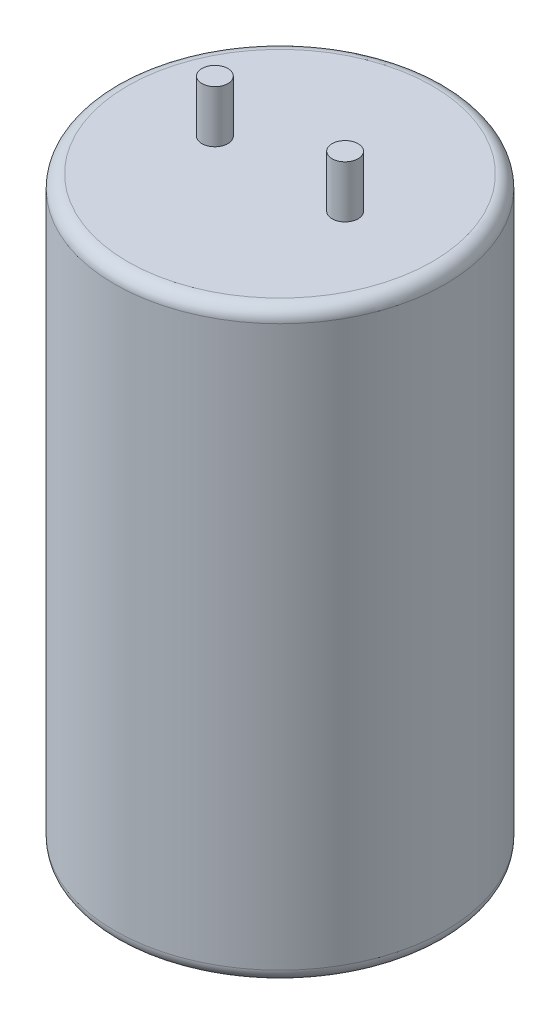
ISO-10303-21;
HEADER;
FILE_DESCRIPTION(('STEP AP214'),'2;1');
FILE_NAME('part.step','',(''),(''),'','','');
FILE_SCHEMA(('AUTOMOTIVE_DESIGN { 1 0 10303 214 1 1 1 1 }'));
ENDSEC;
DATA;
#1=APPLICATION_CONTEXT('core data for automotive mechanical design processes');
#2=APPLICATION_PROTOCOL_DEFINITION('international standard','automotive_design',2000,#1);
#3=PRODUCT_CONTEXT('',#1,'mechanical');
#4=PRODUCT('Part','Part','',(#3));
#5=PRODUCT_RELATED_PRODUCT_CATEGORY('part','',(#4));
#6=PRODUCT_DEFINITION_FORMATION('','',#4);
#7=PRODUCT_DEFINITION_CONTEXT('part definition',#1,'design');
#8=PRODUCT_DEFINITION('design','',#6,#7);
#9=PRODUCT_DEFINITION_SHAPE('','',#8);
#10=(LENGTH_UNIT() NAMED_UNIT(*) SI_UNIT(.MILLI.,.METRE.));
#11=(NAMED_UNIT(*) PLANE_ANGLE_UNIT() SI_UNIT($,.RADIAN.));
#12=(NAMED_UNIT(*) SI_UNIT($,.STERADIAN.) SOLID_ANGLE_UNIT());
#13=UNCERTAINTY_MEASURE_WITH_UNIT(LENGTH_MEASURE(1.E-05),#10,'distance_accuracy_value','');
#14=(GEOMETRIC_REPRESENTATION_CONTEXT(3) GLOBAL_UNCERTAINTY_ASSIGNED_CONTEXT((#13)) GLOBAL_UNIT_ASSIGNED_CONTEXT((#10,
#11,#12)) REPRESENTATION_CONTEXT('',''));
#15=CARTESIAN_POINT('',(0.,0.,0.));
#16=DIRECTION('',(0.,0.,1.));
#17=DIRECTION('',(1.,0.,0.));
#18=AXIS2_PLACEMENT_3D('',#15,#16,#17);
#19=CARTESIAN_POINT('',(0.,45.,0.));
#20=DIRECTION('',(0.,-1.,0.));
#21=DIRECTION('',(0.,0.,-1.));
#22=AXIS2_PLACEMENT_3D('',#19,#20,#21);
#23=CYLINDRICAL_SURFACE('',#22,12.7);
#24=CARTESIAN_POINT('',(0.,1.,0.));
#25=DIRECTION('',(0.,1.,0.));
#26=DIRECTION('',(0.,0.,1.));
#27=AXIS2_PLACEMENT_3D('',#24,#25,#26);
#28=CIRCLE('',#27,12.7);
#29=CARTESIAN_POINT('',(0.,0.999999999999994,-12.7));
#30=VERTEX_POINT('',#29);
#31=EDGE_CURVE('E43',#30,#30,#28,.T.);
#32=CARTESIAN_POINT('',(0.,44.,0.));
#33=DIRECTION('',(0.,1.,0.));
#34=DIRECTION('',(0.,0.,1.));
#35=AXIS2_PLACEMENT_3D('',#32,#33,#34);
#36=CIRCLE('',#35,12.7);
#37=CARTESIAN_POINT('',(0.,44.,-12.7));
#38=VERTEX_POINT('',#37);
#39=EDGE_CURVE('E47',#38,#38,#36,.F.);
#40=CARTESIAN_POINT('',(0.,0.999999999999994,-12.7));
#41=CARTESIAN_POINT('',(0.,1.44791666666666,-12.7));
#42=CARTESIAN_POINT('',(0.,1.89583333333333,-12.7));
#43=CARTESIAN_POINT('',(0.,2.79166666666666,-12.7));
#44=CARTESIAN_POINT('',(0.,3.23958333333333,-12.7));
#45=CARTESIAN_POINT('',(0.,4.13541666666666,-12.7));
#46=CARTESIAN_POINT('',(0.,4.58333333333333,-12.7));
#47=CARTESIAN_POINT('',(0.,5.47916666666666,-12.7));
#48=CARTESIAN_POINT('',(0.,5.92708333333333,-12.7));
#49=CARTESIAN_POINT('',(0.,6.82291666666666,-12.7));
#50=CARTESIAN_POINT('',(0.,7.27083333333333,-12.7));
#51=CARTESIAN_POINT('',(0.,8.16666666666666,-12.7));
#52=CARTESIAN_POINT('',(0.,8.61458333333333,-12.7));
#53=CARTESIAN_POINT('',(0.,9.51041666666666,-12.7));
#54=CARTESIAN_POINT('',(0.,9.95833333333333,-12.7));
#55=CARTESIAN_POINT('',(0.,10.8541666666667,-12.7));
#56=CARTESIAN_POINT('',(0.,11.3020833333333,-12.7));
#57=CARTESIAN_POINT('',(0.,12.1979166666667,-12.7));
#58=CARTESIAN_POINT('',(0.,12.6458333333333,-12.7));
#59=CARTESIAN_POINT('',(0.,13.5416666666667,-12.7));
#60=CARTESIAN_POINT('',(0.,13.9895833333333,-12.7));
#61=CARTESIAN_POINT('',(0.,14.8854166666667,-12.7));
#62=CARTESIAN_POINT('',(0.,15.3333333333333,-12.7));
#63=CARTESIAN_POINT('',(0.,16.2291666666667,-12.7));
#64=CARTESIAN_POINT('',(0.,16.6770833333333,-12.7));
#65=CARTESIAN_POINT('',(0.,17.5729166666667,-12.7));
#66=CARTESIAN_POINT('',(0.,18.0208333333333,-12.7));
#67=CARTESIAN_POINT('',(0.,18.9166666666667,-12.7));
#68=CARTESIAN_POINT('',(0.,19.3645833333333,-12.7));
#69=CARTESIAN_POINT('',(0.,20.2604166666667,-12.7));
#70=CARTESIAN_POINT('',(0.,20.7083333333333,-12.7));
#71=CARTESIAN_POINT('',(0.,21.6041666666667,-12.7));
#72=CARTESIAN_POINT('',(0.,22.0520833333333,-12.7));
#73=CARTESIAN_POINT('',(0.,22.9479166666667,-12.7));
#74=CARTESIAN_POINT('',(0.,23.3958333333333,-12.7));
#75=CARTESIAN_POINT('',(0.,24.2916666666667,-12.7));
#76=CARTESIAN_POINT('',(0.,24.7395833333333,-12.7));
#77=CARTESIAN_POINT('',(0.,25.6354166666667,-12.7));
#78=CARTESIAN_POINT('',(0.,26.0833333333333,-12.7));
#79=CARTESIAN_POINT('',(0.,26.9791666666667,-12.7));
#80=CARTESIAN_POINT('',(0.,27.4270833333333,-12.7));
#81=CARTESIAN_POINT('',(0.,28.3229166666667,-12.7));
#82=CARTESIAN_POINT('',(0.,28.7708333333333,-12.7));
#83=CARTESIAN_POINT('',(0.,29.6666666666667,-12.7));
#84=CARTESIAN_POINT('',(0.,30.1145833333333,-12.7));
#85=CARTESIAN_POINT('',(0.,31.0104166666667,-12.7));
#86=CARTESIAN_POINT('',(0.,31.4583333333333,-12.7));
#87=CARTESIAN_POINT('',(0.,32.3541666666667,-12.7));
#88=CARTESIAN_POINT('',(0.,32.8020833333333,-12.7));
#89=CARTESIAN_POINT('',(0.,33.6979166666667,-12.7));
#90=CARTESIAN_POINT('',(0.,34.1458333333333,-12.7));
#91=CARTESIAN_POINT('',(0.,35.0416666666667,-12.7));
#92=CARTESIAN_POINT('',(0.,35.4895833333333,-12.7));
#93=CARTESIAN_POINT('',(0.,36.3854166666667,-12.7));
#94=CARTESIAN_POINT('',(0.,36.8333333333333,-12.7));
#95=CARTESIAN_POINT('',(0.,37.7291666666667,-12.7));
#96=CARTESIAN_POINT('',(0.,38.1770833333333,-12.7));
#97=CARTESIAN_POINT('',(0.,39.0729166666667,-12.7));
#98=CARTESIAN_POINT('',(0.,39.5208333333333,-12.7));
#99=CARTESIAN_POINT('',(0.,40.4166666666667,-12.7));
#100=CARTESIAN_POINT('',(0.,40.8645833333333,-12.7));
#101=CARTESIAN_POINT('',(0.,41.7604166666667,-12.7));
#102=CARTESIAN_POINT('',(0.,42.2083333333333,-12.7));
#103=CARTESIAN_POINT('',(0.,43.1041666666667,-12.7));
#104=CARTESIAN_POINT('',(0.,43.5520833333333,-12.7));
#105=CARTESIAN_POINT('',(0.,44.,-12.7));
#106=B_SPLINE_CURVE_WITH_KNOTS('',3,(#40,#41,#42,#43,#44,#45,#46,#47,#48,#49,#50,#51,#52,#53,
#54,#55,#56,#57,#58,#59,#60,#61,#62,#63,#64,#65,#66,#67,#68,#69,#70,#71,#72,#73,#74,#75,#76,#77,
#78,#79,#80,#81,#82,#83,#84,#85,#86,#87,#88,#89,#90,#91,#92,#93,#94,#95,#96,#97,#98,#99,#100,
#101,#102,#103,#104,#105),.UNSPECIFIED.,.F.,.F.,(4,2,2,2,2,2,2,2,2,2,2,2,2,2,2,2,2,2,2,2,2,2,2,
2,2,2,2,2,2,2,2,2,4),(0.,1.34375,2.6875,4.03125,5.375,6.71875,8.0625,9.40625000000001,10.75,
12.09375,13.4375,14.78125,16.125,17.46875,18.8125,20.15625,21.5,22.84375,24.1875,25.53125,
26.875,28.21875,29.5625,30.90625,32.25,33.59375,34.9375,36.28125,37.625,38.96875,40.3125,
41.65625,43.),.UNSPECIFIED.);
#107=EDGE_CURVE('BSEAM32',#30,#38,#106,.T.);
#108=ORIENTED_EDGE('',*,*,#31,.T.);
#109=ORIENTED_EDGE('',*,*,#39,.T.);
#110=ORIENTED_EDGE('',*,*,#107,.T.);
#111=ORIENTED_EDGE('',*,*,#107,.F.);
#112=EDGE_LOOP('',(#108,#110,#109,#111));
#113=FACE_BOUND('',#112,.T.);
#114=ADVANCED_FACE('F32',(#113),#23,.T.);
#115=CARTESIAN_POINT('',(0.,45.,0.));
#116=DIRECTION('',(0.,1.,0.));
#117=DIRECTION('',(0.,0.,1.));
#118=AXIS2_PLACEMENT_3D('',#115,#116,#117);
#119=PLANE('',#118);
#120=CARTESIAN_POINT('',(-5.,45.,0.));
#121=DIRECTION('',(0.,1.,0.));
#122=DIRECTION('',(0.,0.,1.));
#123=AXIS2_PLACEMENT_3D('',#120,#121,#122);
#124=CIRCLE('',#123,1.);
#125=CARTESIAN_POINT('',(-5.,45.,1.));
#126=VERTEX_POINT('',#125);
#127=EDGE_CURVE('E59',#126,#126,#124,.T.);
#128=ORIENTED_EDGE('',*,*,#127,.F.);
#129=EDGE_LOOP('',(#128));
#130=FACE_BOUND('',#129,.T.);
#131=CARTESIAN_POINT('',(5.,45.,0.));
#132=DIRECTION('',(0.,1.,0.));
#133=DIRECTION('',(0.,0.,1.));
#134=AXIS2_PLACEMENT_3D('',#131,#132,#133);
#135=CIRCLE('',#134,1.);
#136=CARTESIAN_POINT('',(5.,45.,1.));
#137=VERTEX_POINT('',#136);
#138=EDGE_CURVE('E53',#137,#137,#135,.T.);
#139=ORIENTED_EDGE('',*,*,#138,.F.);
#140=EDGE_LOOP('',(#139));
#141=FACE_BOUND('',#140,.T.);
#142=CARTESIAN_POINT('',(0.,45.,0.));
#143=DIRECTION('',(0.,1.,0.));
#144=DIRECTION('',(0.,0.,1.));
#145=AXIS2_PLACEMENT_3D('',#142,#143,#144);
#146=CIRCLE('',#145,11.7);
#147=CARTESIAN_POINT('',(0.,45.,11.7));
#148=VERTEX_POINT('',#147);
#149=EDGE_CURVE('E10',#148,#148,#146,.T.);
#150=ORIENTED_EDGE('',*,*,#149,.T.);
#151=EDGE_LOOP('',(#150));
#152=FACE_BOUND('',#151,.T.);
#153=ADVANCED_FACE('F74',(#130,#141,#152),#119,.T.);
#154=CARTESIAN_POINT('',(0.,0.,0.));
#155=DIRECTION('',(0.,1.,0.));
#156=DIRECTION('',(0.,0.,1.));
#157=AXIS2_PLACEMENT_3D('',#154,#155,#156);
#158=PLANE('',#157);
#159=CARTESIAN_POINT('',(0.,0.,0.));
#160=DIRECTION('',(0.,1.,0.));
#161=DIRECTION('',(0.,0.,1.));
#162=AXIS2_PLACEMENT_3D('',#159,#160,#161);
#163=CIRCLE('',#162,11.7);
#164=CARTESIAN_POINT('',(0.,0.,11.7));
#165=VERTEX_POINT('',#164);
#166=EDGE_CURVE('E39',#165,#165,#163,.F.);
#167=ORIENTED_EDGE('',*,*,#166,.T.);
#168=EDGE_LOOP('',(#167));
#169=FACE_BOUND('',#168,.T.);
#170=ADVANCED_FACE('F77',(#169),#158,.F.);
#171=CARTESIAN_POINT('',(0.,1.,0.));
#172=DIRECTION('',(0.,1.,0.));
#173=DIRECTION('',(0.,0.,1.));
#174=AXIS2_PLACEMENT_3D('',#171,#172,#173);
#175=TOROIDAL_SURFACE('',#174,11.7,1.);
#176=ORIENTED_EDGE('',*,*,#166,.F.);
#177=EDGE_LOOP('',(#176));
#178=FACE_BOUND('',#177,.T.);
#179=ORIENTED_EDGE('',*,*,#31,.F.);
#180=EDGE_LOOP('',(#179));
#181=FACE_BOUND('',#180,.T.);
#182=ADVANCED_FACE('F91',(#178,#181),#175,.T.);
#183=CARTESIAN_POINT('',(0.,44.,0.));
#184=DIRECTION('',(0.,1.,0.));
#185=DIRECTION('',(0.,0.,1.));
#186=AXIS2_PLACEMENT_3D('',#183,#184,#185);
#187=TOROIDAL_SURFACE('',#186,11.7,1.);
#188=ORIENTED_EDGE('',*,*,#39,.F.);
#189=EDGE_LOOP('',(#188));
#190=FACE_BOUND('',#189,.T.);
#191=ORIENTED_EDGE('',*,*,#149,.F.);
#192=EDGE_LOOP('',(#191));
#193=FACE_BOUND('',#192,.T.);
#194=ADVANCED_FACE('F34',(#190,#193),#187,.T.);
#195=CARTESIAN_POINT('',(5.,49.,0.));
#196=DIRECTION('',(0.,-1.,0.));
#197=DIRECTION('',(0.,0.,-1.));
#198=AXIS2_PLACEMENT_3D('',#195,#196,#197);
#199=CYLINDRICAL_SURFACE('',#198,1.);
#200=CARTESIAN_POINT('',(5.,49.,0.));
#201=DIRECTION('',(0.,1.,0.));
#202=DIRECTION('',(0.,0.,1.));
#203=AXIS2_PLACEMENT_3D('',#200,#201,#202);
#204=CIRCLE('',#203,1.);
#205=CARTESIAN_POINT('',(5.,49.,1.));
#206=VERTEX_POINT('',#205);
#207=EDGE_CURVE('E52',#206,#206,#204,.T.);
#208=ORIENTED_EDGE('',*,*,#207,.F.);
#209=EDGE_LOOP('',(#208));
#210=FACE_BOUND('',#209,.T.);
#211=ORIENTED_EDGE('',*,*,#138,.T.);
#212=EDGE_LOOP('',(#211));
#213=FACE_BOUND('',#212,.T.);
#214=ADVANCED_FACE('F81',(#210,#213),#199,.T.);
#215=CARTESIAN_POINT('',(5.,49.,0.));
#216=DIRECTION('',(0.,1.,0.));
#217=DIRECTION('',(0.,0.,1.));
#218=AXIS2_PLACEMENT_3D('',#215,#216,#217);
#219=PLANE('',#218);
#220=ORIENTED_EDGE('',*,*,#207,.T.);
#221=EDGE_LOOP('',(#220));
#222=FACE_BOUND('',#221,.T.);
#223=ADVANCED_FACE('F70',(#222),#219,.T.);
#224=CARTESIAN_POINT('',(-5.,49.,0.));
#225=DIRECTION('',(0.,-1.,0.));
#226=DIRECTION('',(0.,0.,-1.));
#227=AXIS2_PLACEMENT_3D('',#224,#225,#226);
#228=CYLINDRICAL_SURFACE('',#227,1.);
#229=CARTESIAN_POINT('',(-5.,49.,0.));
#230=DIRECTION('',(0.,1.,0.));
#231=DIRECTION('',(0.,0.,1.));
#232=AXIS2_PLACEMENT_3D('',#229,#230,#231);
#233=CIRCLE('',#232,1.);
#234=CARTESIAN_POINT('',(-5.,49.,1.));
#235=VERTEX_POINT('',#234);
#236=EDGE_CURVE('E56',#235,#235,#233,.T.);
#237=ORIENTED_EDGE('',*,*,#236,.F.);
#238=EDGE_LOOP('',(#237));
#239=FACE_BOUND('',#238,.T.);
#240=ORIENTED_EDGE('',*,*,#127,.T.);
#241=EDGE_LOOP('',(#240));
#242=FACE_BOUND('',#241,.T.);
#243=ADVANCED_FACE('F67',(#239,#242),#228,.T.);
#244=CARTESIAN_POINT('',(-5.,49.,0.));
#245=DIRECTION('',(0.,1.,0.));
#246=DIRECTION('',(0.,0.,1.));
#247=AXIS2_PLACEMENT_3D('',#244,#245,#246);
#248=PLANE('',#247);
#249=ORIENTED_EDGE('',*,*,#236,.T.);
#250=EDGE_LOOP('',(#249));
#251=FACE_BOUND('',#250,.T.);
#252=ADVANCED_FACE('F65',(#251),#248,.T.);
#253=CLOSED_SHELL('',(#114,#153,#170,#182,#194,#214,#223,#243,#252));
#254=MANIFOLD_SOLID_BREP('B2',#253);
#255=ADVANCED_BREP_SHAPE_REPRESENTATION('',(#18,#254),#14);
#256=SHAPE_DEFINITION_REPRESENTATION(#9,#255);
ENDSEC;
END-ISO-10303-21;
